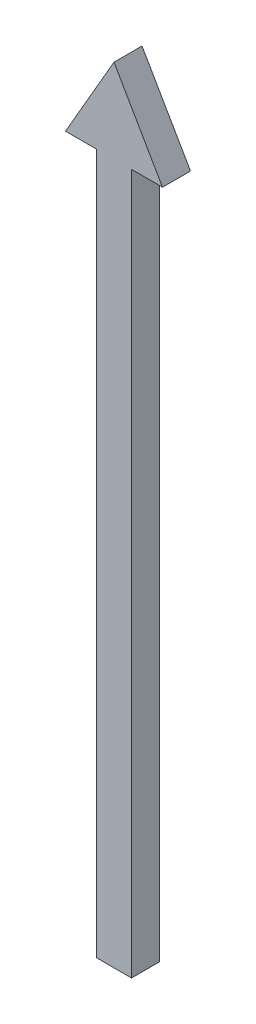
from build123d import *

# Parameters (mm, degrees)
BOSS_EXTRU_1_DEPTH = 2


with BuildPart() as part:
    # Esquisse1 → Boss.-Extru.1 (new, symmetric)
    with BuildSketch(Plane.XY):
        Polygon((2.5, 270), (6.92820323, 270), (0, 282), (-6.92820323, 270), (-2.5, 270), (-2.5, 170), (2.5, 170), align=None)
    extrude(amount=BOSS_EXTRU_1_DEPTH, both=True)


solid = part.part
